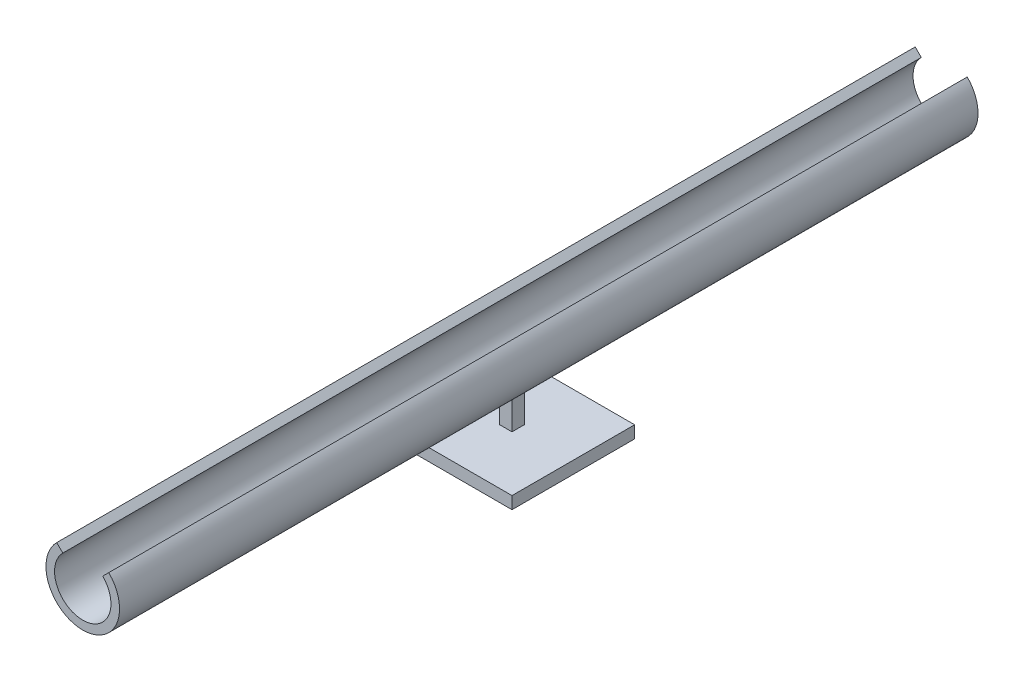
ISO-10303-21;
HEADER;
FILE_DESCRIPTION(('STEP AP214'),'2;1');
FILE_NAME('part.step','',(''),(''),'','','');
FILE_SCHEMA(('AUTOMOTIVE_DESIGN { 1 0 10303 214 1 1 1 1 }'));
ENDSEC;
DATA;
#1=APPLICATION_CONTEXT('core data for automotive mechanical design processes');
#2=APPLICATION_PROTOCOL_DEFINITION('international standard','automotive_design',2000,#1);
#3=PRODUCT_CONTEXT('',#1,'mechanical');
#4=PRODUCT('Part','Part','',(#3));
#5=PRODUCT_RELATED_PRODUCT_CATEGORY('part','',(#4));
#6=PRODUCT_DEFINITION_FORMATION('','',#4);
#7=PRODUCT_DEFINITION_CONTEXT('part definition',#1,'design');
#8=PRODUCT_DEFINITION('design','',#6,#7);
#9=PRODUCT_DEFINITION_SHAPE('','',#8);
#10=(LENGTH_UNIT() NAMED_UNIT(*) SI_UNIT(.MILLI.,.METRE.));
#11=(NAMED_UNIT(*) PLANE_ANGLE_UNIT() SI_UNIT($,.RADIAN.));
#12=(NAMED_UNIT(*) SI_UNIT($,.STERADIAN.) SOLID_ANGLE_UNIT());
#13=UNCERTAINTY_MEASURE_WITH_UNIT(LENGTH_MEASURE(1.E-05),#10,'distance_accuracy_value','');
#14=(GEOMETRIC_REPRESENTATION_CONTEXT(3) GLOBAL_UNCERTAINTY_ASSIGNED_CONTEXT((#13)) GLOBAL_UNIT_ASSIGNED_CONTEXT((#10,
#11,#12)) REPRESENTATION_CONTEXT('',''));
#15=CARTESIAN_POINT('',(0.,0.,0.));
#16=DIRECTION('',(0.,0.,1.));
#17=DIRECTION('',(1.,0.,0.));
#18=AXIS2_PLACEMENT_3D('',#15,#16,#17);
#19=CARTESIAN_POINT('',(0.,0.,350.));
#20=DIRECTION('',(0.,0.,-1.));
#21=DIRECTION('',(-1.,0.,0.));
#22=AXIS2_PLACEMENT_3D('',#19,#20,#21);
#23=CYLINDRICAL_SURFACE('',#22,30.);
#24=DIRECTION('',(0.,0.,-1.));
#25=VECTOR('',#24,1.);
#26=CARTESIAN_POINT('',(-5.,-29.5803989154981,5.));
#27=LINE('',#26,#25);
#28=CARTESIAN_POINT('',(-5.00000000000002,-29.5803989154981,5.));
#29=VERTEX_POINT('',#28);
#30=CARTESIAN_POINT('',(-5.,-29.5803989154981,-5.));
#31=VERTEX_POINT('',#30);
#32=EDGE_CURVE('E47',#29,#31,#27,.T.);
#33=ORIENTED_EDGE('',*,*,#32,.F.);
#34=CARTESIAN_POINT('',(0.,0.,5.));
#35=DIRECTION('',(0.,0.,1.));
#36=DIRECTION('',(1.,0.,0.));
#37=AXIS2_PLACEMENT_3D('',#34,#35,#36);
#38=CIRCLE('',#37,30.);
#39=CARTESIAN_POINT('',(5.00000000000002,-29.5803989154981,5.));
#40=VERTEX_POINT('',#39);
#41=EDGE_CURVE('E11',#29,#40,#38,.T.);
#42=ORIENTED_EDGE('',*,*,#41,.T.);
#43=DIRECTION('',(0.,0.,-1.));
#44=VECTOR('',#43,1.);
#45=CARTESIAN_POINT('',(5.,-29.5803989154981,5.));
#46=LINE('',#45,#44);
#47=CARTESIAN_POINT('',(5.,-29.5803989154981,-5.));
#48=VERTEX_POINT('',#47);
#49=EDGE_CURVE('E163',#40,#48,#46,.T.);
#50=ORIENTED_EDGE('',*,*,#49,.T.);
#51=CARTESIAN_POINT('',(0.,0.,-5.));
#52=DIRECTION('',(0.,0.,1.));
#53=DIRECTION('',(1.,0.,0.));
#54=AXIS2_PLACEMENT_3D('',#51,#52,#53);
#55=CIRCLE('',#54,30.);
#56=EDGE_CURVE('E41',#31,#48,#55,.T.);
#57=ORIENTED_EDGE('',*,*,#56,.F.);
#58=EDGE_LOOP('',(#33,#42,#50,#57));
#59=FACE_BOUND('',#58,.T.);
#60=CARTESIAN_POINT('',(0.,0.,-350.));
#61=DIRECTION('',(0.,0.,1.));
#62=DIRECTION('',(1.,0.,0.));
#63=AXIS2_PLACEMENT_3D('',#60,#61,#62);
#64=CIRCLE('',#63,30.);
#65=CARTESIAN_POINT('',(-21.2132034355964,21.2132034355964,-350.));
#66=VERTEX_POINT('',#65);
#67=CARTESIAN_POINT('',(21.2132034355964,21.2132034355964,-350.));
#68=VERTEX_POINT('',#67);
#69=EDGE_CURVE('E170',#66,#68,#64,.T.);
#70=ORIENTED_EDGE('',*,*,#69,.T.);
#71=DIRECTION('',(0.,0.,-1.));
#72=VECTOR('',#71,1.);
#73=CARTESIAN_POINT('',(21.2132034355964,21.2132034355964,350.));
#74=LINE('',#73,#72);
#75=CARTESIAN_POINT('',(21.2132034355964,21.2132034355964,350.));
#76=VERTEX_POINT('',#75);
#77=EDGE_CURVE('E197',#76,#68,#74,.T.);
#78=ORIENTED_EDGE('',*,*,#77,.F.);
#79=CARTESIAN_POINT('',(0.,0.,350.));
#80=DIRECTION('',(0.,0.,1.));
#81=DIRECTION('',(1.,0.,0.));
#82=AXIS2_PLACEMENT_3D('',#79,#80,#81);
#83=CIRCLE('',#82,30.);
#84=CARTESIAN_POINT('',(-21.2132034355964,21.2132034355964,350.));
#85=VERTEX_POINT('',#84);
#86=EDGE_CURVE('E171',#85,#76,#83,.T.);
#87=ORIENTED_EDGE('',*,*,#86,.F.);
#88=DIRECTION('',(0.,0.,-1.));
#89=VECTOR('',#88,1.);
#90=CARTESIAN_POINT('',(-21.2132034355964,21.2132034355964,350.));
#91=LINE('',#90,#89);
#92=EDGE_CURVE('E181',#85,#66,#91,.T.);
#93=ORIENTED_EDGE('',*,*,#92,.T.);
#94=EDGE_LOOP('',(#70,#78,#87,#93));
#95=FACE_BOUND('',#94,.T.);
#96=ADVANCED_FACE('F34',(#59,#95),#23,.T.);
#97=CARTESIAN_POINT('',(16.2634559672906,16.2634559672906,350.));
#98=DIRECTION('',(0.707106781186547,-0.707106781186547,0.));
#99=DIRECTION('',(0.707106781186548,0.707106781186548,0.));
#100=AXIS2_PLACEMENT_3D('',#97,#98,#99);
#101=PLANE('',#100);
#102=DIRECTION('',(-0.707106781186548,-0.707106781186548,0.));
#103=VECTOR('',#102,1.);
#104=CARTESIAN_POINT('',(16.2634559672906,16.2634559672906,-350.));
#105=LINE('',#104,#103);
#106=CARTESIAN_POINT('',(16.2634559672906,16.2634559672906,-350.));
#107=VERTEX_POINT('',#106);
#108=EDGE_CURVE('E184',#68,#107,#105,.T.);
#109=ORIENTED_EDGE('',*,*,#108,.T.);
#110=DIRECTION('',(0.,0.,-1.));
#111=VECTOR('',#110,1.);
#112=CARTESIAN_POINT('',(16.2634559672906,16.2634559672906,350.));
#113=LINE('',#112,#111);
#114=CARTESIAN_POINT('',(16.2634559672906,16.2634559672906,350.));
#115=VERTEX_POINT('',#114);
#116=EDGE_CURVE('E194',#115,#107,#113,.T.);
#117=ORIENTED_EDGE('',*,*,#116,.F.);
#118=DIRECTION('',(-0.707106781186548,-0.707106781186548,0.));
#119=VECTOR('',#118,1.);
#120=CARTESIAN_POINT('',(16.2634559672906,16.2634559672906,350.));
#121=LINE('',#120,#119);
#122=EDGE_CURVE('E174',#76,#115,#121,.T.);
#123=ORIENTED_EDGE('',*,*,#122,.F.);
#124=ORIENTED_EDGE('',*,*,#77,.T.);
#125=EDGE_LOOP('',(#109,#117,#123,#124));
#126=FACE_BOUND('',#125,.T.);
#127=ADVANCED_FACE('F229',(#126),#101,.F.);
#128=CARTESIAN_POINT('',(0.,0.,350.));
#129=DIRECTION('',(0.,0.,-1.));
#130=DIRECTION('',(-1.,0.,0.));
#131=AXIS2_PLACEMENT_3D('',#128,#129,#130);
#132=CYLINDRICAL_SURFACE('',#131,23.);
#133=CARTESIAN_POINT('',(0.,0.,-350.));
#134=DIRECTION('',(0.,0.,-1.));
#135=DIRECTION('',(1.,0.,0.));
#136=AXIS2_PLACEMENT_3D('',#133,#134,#135);
#137=CIRCLE('',#136,23.);
#138=CARTESIAN_POINT('',(-16.2634559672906,16.2634559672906,-350.));
#139=VERTEX_POINT('',#138);
#140=EDGE_CURVE('E186',#107,#139,#137,.T.);
#141=ORIENTED_EDGE('',*,*,#140,.T.);
#142=DIRECTION('',(0.,0.,-1.));
#143=VECTOR('',#142,1.);
#144=CARTESIAN_POINT('',(-16.2634559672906,16.2634559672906,350.));
#145=LINE('',#144,#143);
#146=CARTESIAN_POINT('',(-16.2634559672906,16.2634559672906,350.));
#147=VERTEX_POINT('',#146);
#148=EDGE_CURVE('E191',#147,#139,#145,.T.);
#149=ORIENTED_EDGE('',*,*,#148,.F.);
#150=CARTESIAN_POINT('',(0.,0.,350.));
#151=DIRECTION('',(0.,0.,-1.));
#152=DIRECTION('',(1.,0.,0.));
#153=AXIS2_PLACEMENT_3D('',#150,#151,#152);
#154=CIRCLE('',#153,23.);
#155=EDGE_CURVE('E177',#115,#147,#154,.T.);
#156=ORIENTED_EDGE('',*,*,#155,.F.);
#157=ORIENTED_EDGE('',*,*,#116,.T.);
#158=EDGE_LOOP('',(#141,#149,#156,#157));
#159=FACE_BOUND('',#158,.T.);
#160=ADVANCED_FACE('F233',(#159),#132,.F.);
#161=CARTESIAN_POINT('',(-16.2634559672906,16.2634559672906,350.));
#162=DIRECTION('',(-0.707106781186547,-0.707106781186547,0.));
#163=DIRECTION('',(0.707106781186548,-0.707106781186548,0.));
#164=AXIS2_PLACEMENT_3D('',#161,#162,#163);
#165=PLANE('',#164);
#166=DIRECTION('',(-0.707106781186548,0.707106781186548,0.));
#167=VECTOR('',#166,1.);
#168=CARTESIAN_POINT('',(-16.2634559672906,16.2634559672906,-350.));
#169=LINE('',#168,#167);
#170=EDGE_CURVE('E175',#139,#66,#169,.T.);
#171=ORIENTED_EDGE('',*,*,#170,.T.);
#172=ORIENTED_EDGE('',*,*,#92,.F.);
#173=DIRECTION('',(-0.707106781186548,0.707106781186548,0.));
#174=VECTOR('',#173,1.);
#175=CARTESIAN_POINT('',(-16.2634559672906,16.2634559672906,350.));
#176=LINE('',#175,#174);
#177=EDGE_CURVE('E179',#147,#85,#176,.T.);
#178=ORIENTED_EDGE('',*,*,#177,.F.);
#179=ORIENTED_EDGE('',*,*,#148,.T.);
#180=EDGE_LOOP('',(#171,#172,#178,#179));
#181=FACE_BOUND('',#180,.T.);
#182=ADVANCED_FACE('F251',(#181),#165,.F.);
#183=CARTESIAN_POINT('',(0.,0.,350.));
#184=DIRECTION('',(0.,0.,1.));
#185=DIRECTION('',(1.,0.,0.));
#186=AXIS2_PLACEMENT_3D('',#183,#184,#185);
#187=PLANE('',#186);
#188=ORIENTED_EDGE('',*,*,#86,.T.);
#189=ORIENTED_EDGE('',*,*,#122,.T.);
#190=ORIENTED_EDGE('',*,*,#155,.T.);
#191=ORIENTED_EDGE('',*,*,#177,.T.);
#192=EDGE_LOOP('',(#188,#189,#190,#191));
#193=FACE_BOUND('',#192,.T.);
#194=ADVANCED_FACE('F247',(#193),#187,.T.);
#195=CARTESIAN_POINT('',(0.,0.,-350.));
#196=DIRECTION('',(0.,0.,1.));
#197=DIRECTION('',(1.,0.,0.));
#198=AXIS2_PLACEMENT_3D('',#195,#196,#197);
#199=PLANE('',#198);
#200=ORIENTED_EDGE('',*,*,#69,.F.);
#201=ORIENTED_EDGE('',*,*,#170,.F.);
#202=ORIENTED_EDGE('',*,*,#140,.F.);
#203=ORIENTED_EDGE('',*,*,#108,.F.);
#204=EDGE_LOOP('',(#200,#201,#202,#203));
#205=FACE_BOUND('',#204,.T.);
#206=ADVANCED_FACE('F242',(#205),#199,.F.);
#207=CARTESIAN_POINT('',(-5.,-29.5803989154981,5.));
#208=DIRECTION('',(1.,0.,0.));
#209=DIRECTION('',(0.,1.,0.));
#210=AXIS2_PLACEMENT_3D('',#207,#208,#209);
#211=PLANE('',#210);
#212=DIRECTION('',(0.,-1.,0.));
#213=VECTOR('',#212,1.);
#214=CARTESIAN_POINT('',(-5.,-29.5803989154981,-5.));
#215=LINE('',#214,#213);
#216=CARTESIAN_POINT('',(-5.,-60.,-5.));
#217=VERTEX_POINT('',#216);
#218=EDGE_CURVE('E143',#31,#217,#215,.T.);
#219=ORIENTED_EDGE('',*,*,#218,.T.);
#220=DIRECTION('',(0.,0.,-1.));
#221=VECTOR('',#220,1.);
#222=CARTESIAN_POINT('',(-5.,-60.,5.));
#223=LINE('',#222,#221);
#224=CARTESIAN_POINT('',(-5.,-60.,5.));
#225=VERTEX_POINT('',#224);
#226=EDGE_CURVE('E167',#225,#217,#223,.T.);
#227=ORIENTED_EDGE('',*,*,#226,.F.);
#228=DIRECTION('',(0.,-1.,0.));
#229=VECTOR('',#228,1.);
#230=CARTESIAN_POINT('',(-5.,-29.5803989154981,5.));
#231=LINE('',#230,#229);
#232=EDGE_CURVE('E151',#29,#225,#231,.T.);
#233=ORIENTED_EDGE('',*,*,#232,.F.);
#234=ORIENTED_EDGE('',*,*,#32,.T.);
#235=EDGE_LOOP('',(#219,#227,#233,#234));
#236=FACE_BOUND('',#235,.T.);
#237=ADVANCED_FACE('F216',(#236),#211,.F.);
#238=CARTESIAN_POINT('',(5.,-29.5803989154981,5.));
#239=DIRECTION('',(-1.,0.,0.));
#240=DIRECTION('',(0.,-1.,0.));
#241=AXIS2_PLACEMENT_3D('',#238,#239,#240);
#242=PLANE('',#241);
#243=DIRECTION('',(0.,1.,0.));
#244=VECTOR('',#243,1.);
#245=CARTESIAN_POINT('',(5.,-29.5803989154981,-5.));
#246=LINE('',#245,#244);
#247=CARTESIAN_POINT('',(5.,-60.,-5.));
#248=VERTEX_POINT('',#247);
#249=EDGE_CURVE('E154',#248,#48,#246,.T.);
#250=ORIENTED_EDGE('',*,*,#249,.T.);
#251=ORIENTED_EDGE('',*,*,#49,.F.);
#252=DIRECTION('',(0.,1.,0.));
#253=VECTOR('',#252,1.);
#254=CARTESIAN_POINT('',(5.,-29.5803989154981,5.));
#255=LINE('',#254,#253);
#256=CARTESIAN_POINT('',(5.,-60.,5.));
#257=VERTEX_POINT('',#256);
#258=EDGE_CURVE('E156',#257,#40,#255,.T.);
#259=ORIENTED_EDGE('',*,*,#258,.F.);
#260=DIRECTION('',(0.,0.,-1.));
#261=VECTOR('',#260,1.);
#262=CARTESIAN_POINT('',(5.,-60.,5.));
#263=LINE('',#262,#261);
#264=EDGE_CURVE('E165',#257,#248,#263,.T.);
#265=ORIENTED_EDGE('',*,*,#264,.T.);
#266=EDGE_LOOP('',(#250,#251,#259,#265));
#267=FACE_BOUND('',#266,.T.);
#268=ADVANCED_FACE('F207',(#267),#242,.F.);
#269=CARTESIAN_POINT('',(0.,0.,5.));
#270=DIRECTION('',(0.,0.,1.));
#271=DIRECTION('',(1.,0.,0.));
#272=AXIS2_PLACEMENT_3D('',#269,#270,#271);
#273=PLANE('',#272);
#274=ORIENTED_EDGE('',*,*,#41,.F.);
#275=ORIENTED_EDGE('',*,*,#232,.T.);
#276=DIRECTION('',(1.,0.,0.));
#277=VECTOR('',#276,1.);
#278=CARTESIAN_POINT('',(-5.,-60.,5.));
#279=LINE('',#278,#277);
#280=EDGE_CURVE('E153',#225,#257,#279,.T.);
#281=ORIENTED_EDGE('',*,*,#280,.T.);
#282=ORIENTED_EDGE('',*,*,#258,.T.);
#283=EDGE_LOOP('',(#274,#275,#281,#282));
#284=FACE_BOUND('',#283,.T.);
#285=ADVANCED_FACE('F218',(#284),#273,.T.);
#286=CARTESIAN_POINT('',(0.,0.,-5.));
#287=DIRECTION('',(0.,0.,1.));
#288=DIRECTION('',(1.,0.,0.));
#289=AXIS2_PLACEMENT_3D('',#286,#287,#288);
#290=PLANE('',#289);
#291=ORIENTED_EDGE('',*,*,#218,.F.);
#292=ORIENTED_EDGE('',*,*,#56,.T.);
#293=ORIENTED_EDGE('',*,*,#249,.F.);
#294=DIRECTION('',(1.,0.,0.));
#295=VECTOR('',#294,1.);
#296=CARTESIAN_POINT('',(-5.,-60.,-5.));
#297=LINE('',#296,#295);
#298=EDGE_CURVE('E145',#217,#248,#297,.T.);
#299=ORIENTED_EDGE('',*,*,#298,.F.);
#300=EDGE_LOOP('',(#291,#292,#293,#299));
#301=FACE_BOUND('',#300,.T.);
#302=ADVANCED_FACE('F203',(#301),#290,.F.);
#303=CARTESIAN_POINT('',(-50.,-60.,50.));
#304=DIRECTION('',(0.,-1.,0.));
#305=DIRECTION('',(1.,0.,0.));
#306=AXIS2_PLACEMENT_3D('',#303,#304,#305);
#307=PLANE('',#306);
#308=DIRECTION('',(-1.,0.,0.));
#309=VECTOR('',#308,1.);
#310=CARTESIAN_POINT('',(-50.,-60.,-50.));
#311=LINE('',#310,#309);
#312=CARTESIAN_POINT('',(50.,-60.,-50.));
#313=VERTEX_POINT('',#312);
#314=CARTESIAN_POINT('',(-50.,-60.,-50.));
#315=VERTEX_POINT('',#314);
#316=EDGE_CURVE('E138',#313,#315,#311,.T.);
#317=ORIENTED_EDGE('',*,*,#316,.T.);
#318=DIRECTION('',(0.,0.,-1.));
#319=VECTOR('',#318,1.);
#320=CARTESIAN_POINT('',(-50.,-60.,50.));
#321=LINE('',#320,#319);
#322=CARTESIAN_POINT('',(-50.,-60.,50.));
#323=VERTEX_POINT('',#322);
#324=EDGE_CURVE('E350',#323,#315,#321,.T.);
#325=ORIENTED_EDGE('',*,*,#324,.F.);
#326=DIRECTION('',(-1.,0.,0.));
#327=VECTOR('',#326,1.);
#328=CARTESIAN_POINT('',(-50.,-60.,50.));
#329=LINE('',#328,#327);
#330=CARTESIAN_POINT('',(50.,-60.,50.));
#331=VERTEX_POINT('',#330);
#332=EDGE_CURVE('E134',#331,#323,#329,.T.);
#333=ORIENTED_EDGE('',*,*,#332,.F.);
#334=DIRECTION('',(0.,0.,-1.));
#335=VECTOR('',#334,1.);
#336=CARTESIAN_POINT('',(50.,-60.,50.));
#337=LINE('',#336,#335);
#338=EDGE_CURVE('E147',#331,#313,#337,.T.);
#339=ORIENTED_EDGE('',*,*,#338,.T.);
#340=EDGE_LOOP('',(#317,#325,#333,#339));
#341=FACE_BOUND('',#340,.T.);
#342=ORIENTED_EDGE('',*,*,#226,.T.);
#343=ORIENTED_EDGE('',*,*,#298,.T.);
#344=ORIENTED_EDGE('',*,*,#264,.F.);
#345=ORIENTED_EDGE('',*,*,#280,.F.);
#346=EDGE_LOOP('',(#342,#343,#344,#345));
#347=FACE_BOUND('',#346,.T.);
#348=ADVANCED_FACE('F212',(#341,#347),#307,.F.);
#349=CARTESIAN_POINT('',(-50.,-60.,50.));
#350=DIRECTION('',(1.,0.,0.));
#351=DIRECTION('',(0.,0.,-1.));
#352=AXIS2_PLACEMENT_3D('',#349,#350,#351);
#353=PLANE('',#352);
#354=DIRECTION('',(0.,-1.,0.));
#355=VECTOR('',#354,1.);
#356=CARTESIAN_POINT('',(-50.,-60.,-50.));
#357=LINE('',#356,#355);
#358=CARTESIAN_POINT('',(-50.,-70.,-50.));
#359=VERTEX_POINT('',#358);
#360=EDGE_CURVE('E142',#315,#359,#357,.T.);
#361=ORIENTED_EDGE('',*,*,#360,.T.);
#362=DIRECTION('',(0.,0.,-1.));
#363=VECTOR('',#362,1.);
#364=CARTESIAN_POINT('',(-50.,-70.,50.));
#365=LINE('',#364,#363);
#366=CARTESIAN_POINT('',(-50.,-70.,50.));
#367=VERTEX_POINT('',#366);
#368=EDGE_CURVE('E122',#367,#359,#365,.T.);
#369=ORIENTED_EDGE('',*,*,#368,.F.);
#370=DIRECTION('',(0.,-1.,0.));
#371=VECTOR('',#370,1.);
#372=CARTESIAN_POINT('',(-50.,-60.,50.));
#373=LINE('',#372,#371);
#374=EDGE_CURVE('E129',#323,#367,#373,.T.);
#375=ORIENTED_EDGE('',*,*,#374,.F.);
#376=ORIENTED_EDGE('',*,*,#324,.T.);
#377=EDGE_LOOP('',(#361,#369,#375,#376));
#378=FACE_BOUND('',#377,.T.);
#379=ADVANCED_FACE('F140',(#378),#353,.F.);
#380=CARTESIAN_POINT('',(-50.,-70.,50.));
#381=DIRECTION('',(0.,1.,0.));
#382=DIRECTION('',(-1.,0.,0.));
#383=AXIS2_PLACEMENT_3D('',#380,#381,#382);
#384=PLANE('',#383);
#385=DIRECTION('',(1.,0.,0.));
#386=VECTOR('',#385,1.);
#387=CARTESIAN_POINT('',(-50.,-70.,-50.));
#388=LINE('',#387,#386);
#389=CARTESIAN_POINT('',(50.,-70.,-50.));
#390=VERTEX_POINT('',#389);
#391=EDGE_CURVE('E341',#359,#390,#388,.T.);
#392=ORIENTED_EDGE('',*,*,#391,.T.);
#393=DIRECTION('',(0.,0.,-1.));
#394=VECTOR('',#393,1.);
#395=CARTESIAN_POINT('',(50.,-70.,50.));
#396=LINE('',#395,#394);
#397=CARTESIAN_POINT('',(50.,-70.,50.));
#398=VERTEX_POINT('',#397);
#399=EDGE_CURVE('E125',#398,#390,#396,.T.);
#400=ORIENTED_EDGE('',*,*,#399,.F.);
#401=DIRECTION('',(1.,0.,0.));
#402=VECTOR('',#401,1.);
#403=CARTESIAN_POINT('',(-50.,-70.,50.));
#404=LINE('',#403,#402);
#405=EDGE_CURVE('E118',#367,#398,#404,.T.);
#406=ORIENTED_EDGE('',*,*,#405,.F.);
#407=ORIENTED_EDGE('',*,*,#368,.T.);
#408=EDGE_LOOP('',(#392,#400,#406,#407));
#409=FACE_BOUND('',#408,.T.);
#410=ADVANCED_FACE('F120',(#409),#384,.F.);
#411=CARTESIAN_POINT('',(50.,-60.,50.));
#412=DIRECTION('',(-1.,0.,0.));
#413=DIRECTION('',(0.,0.,1.));
#414=AXIS2_PLACEMENT_3D('',#411,#412,#413);
#415=PLANE('',#414);
#416=DIRECTION('',(0.,1.,0.));
#417=VECTOR('',#416,1.);
#418=CARTESIAN_POINT('',(50.,-60.,-50.));
#419=LINE('',#418,#417);
#420=EDGE_CURVE('E343',#390,#313,#419,.T.);
#421=ORIENTED_EDGE('',*,*,#420,.T.);
#422=ORIENTED_EDGE('',*,*,#338,.F.);
#423=DIRECTION('',(0.,1.,0.));
#424=VECTOR('',#423,1.);
#425=CARTESIAN_POINT('',(50.,-60.,50.));
#426=LINE('',#425,#424);
#427=EDGE_CURVE('E128',#398,#331,#426,.T.);
#428=ORIENTED_EDGE('',*,*,#427,.F.);
#429=ORIENTED_EDGE('',*,*,#399,.T.);
#430=EDGE_LOOP('',(#421,#422,#428,#429));
#431=FACE_BOUND('',#430,.T.);
#432=ADVANCED_FACE('F308',(#431),#415,.F.);
#433=CARTESIAN_POINT('',(0.,0.,50.));
#434=DIRECTION('',(0.,0.,1.));
#435=DIRECTION('',(1.,0.,0.));
#436=AXIS2_PLACEMENT_3D('',#433,#434,#435);
#437=PLANE('',#436);
#438=ORIENTED_EDGE('',*,*,#374,.T.);
#439=ORIENTED_EDGE('',*,*,#405,.T.);
#440=ORIENTED_EDGE('',*,*,#427,.T.);
#441=ORIENTED_EDGE('',*,*,#332,.T.);
#442=EDGE_LOOP('',(#438,#439,#440,#441));
#443=FACE_BOUND('',#442,.T.);
#444=ADVANCED_FACE('F132',(#443),#437,.T.);
#445=CARTESIAN_POINT('',(0.,0.,-50.));
#446=DIRECTION('',(0.,0.,1.));
#447=DIRECTION('',(1.,0.,0.));
#448=AXIS2_PLACEMENT_3D('',#445,#446,#447);
#449=PLANE('',#448);
#450=ORIENTED_EDGE('',*,*,#360,.F.);
#451=ORIENTED_EDGE('',*,*,#316,.F.);
#452=ORIENTED_EDGE('',*,*,#420,.F.);
#453=ORIENTED_EDGE('',*,*,#391,.F.);
#454=EDGE_LOOP('',(#450,#451,#452,#453));
#455=FACE_BOUND('',#454,.T.);
#456=ADVANCED_FACE('F326',(#455),#449,.F.);
#457=CLOSED_SHELL('',(#96,#127,#160,#182,#194,#206,#237,#268,#285,#302,#348,#379,#410,#432,#444,#456));
#458=MANIFOLD_SOLID_BREP('B2',#457);
#459=ADVANCED_BREP_SHAPE_REPRESENTATION('',(#18,#458),#14);
#460=SHAPE_DEFINITION_REPRESENTATION(#9,#459);
ENDSEC;
END-ISO-10303-21;
